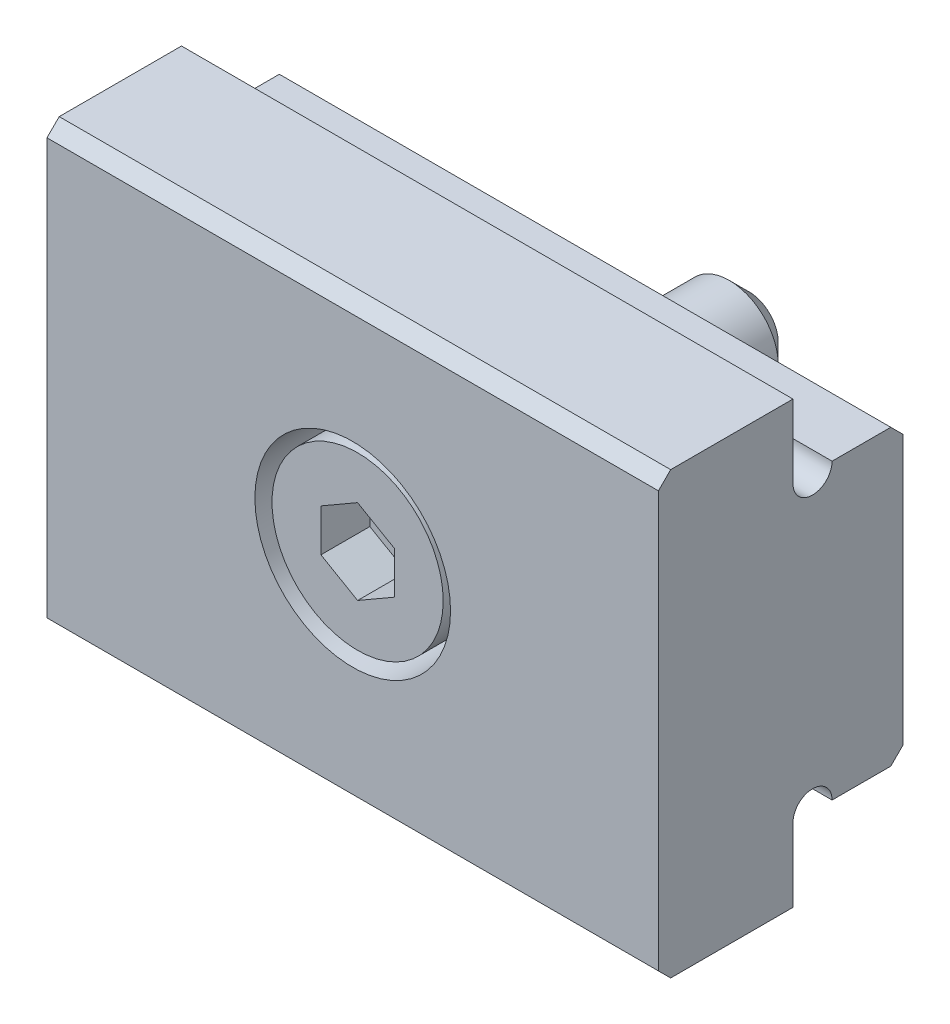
ISO-10303-21;
HEADER;
FILE_DESCRIPTION(('STEP AP214'),'2;1');
FILE_NAME('part.step','',(''),(''),'','','');
FILE_SCHEMA(('AUTOMOTIVE_DESIGN { 1 0 10303 214 1 1 1 1 }'));
ENDSEC;
DATA;
#1=APPLICATION_CONTEXT('core data for automotive mechanical design processes');
#2=APPLICATION_PROTOCOL_DEFINITION('international standard','automotive_design',2000,#1);
#3=PRODUCT_CONTEXT('',#1,'mechanical');
#4=PRODUCT('Part','Part','',(#3));
#5=PRODUCT_RELATED_PRODUCT_CATEGORY('part','',(#4));
#6=PRODUCT_DEFINITION_FORMATION('','',#4);
#7=PRODUCT_DEFINITION_CONTEXT('part definition',#1,'design');
#8=PRODUCT_DEFINITION('design','',#6,#7);
#9=PRODUCT_DEFINITION_SHAPE('','',#8);
#10=(LENGTH_UNIT() NAMED_UNIT(*) SI_UNIT(.MILLI.,.METRE.));
#11=(NAMED_UNIT(*) PLANE_ANGLE_UNIT() SI_UNIT($,.RADIAN.));
#12=(NAMED_UNIT(*) SI_UNIT($,.STERADIAN.) SOLID_ANGLE_UNIT());
#13=UNCERTAINTY_MEASURE_WITH_UNIT(LENGTH_MEASURE(1.E-05),#10,'distance_accuracy_value','');
#14=(GEOMETRIC_REPRESENTATION_CONTEXT(3) GLOBAL_UNCERTAINTY_ASSIGNED_CONTEXT((#13)) GLOBAL_UNIT_ASSIGNED_CONTEXT((#10,
#11,#12)) REPRESENTATION_CONTEXT('',''));
#15=CARTESIAN_POINT('',(0.,0.,0.));
#16=DIRECTION('',(0.,0.,1.));
#17=DIRECTION('',(1.,0.,0.));
#18=AXIS2_PLACEMENT_3D('',#15,#16,#17);
#19=CARTESIAN_POINT('',(-12.5,-6.,-0.799999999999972));
#20=DIRECTION('',(1.,0.,0.));
#21=DIRECTION('',(0.,1.,0.));
#22=AXIS2_PLACEMENT_3D('',#19,#20,#21);
#23=CYLINDRICAL_SURFACE('',#22,0.8);
#24=CARTESIAN_POINT('',(12.5,-6.,-0.799999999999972));
#25=DIRECTION('',(1.,0.,0.));
#26=DIRECTION('',(0.,-1.,0.));
#27=AXIS2_PLACEMENT_3D('',#24,#25,#26);
#28=CIRCLE('',#27,0.8);
#29=CARTESIAN_POINT('',(12.5,-6.,-1.59999999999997));
#30=VERTEX_POINT('',#29);
#31=CARTESIAN_POINT('',(12.5,-6.,0.));
#32=VERTEX_POINT('',#31);
#33=EDGE_CURVE('E86',#30,#32,#28,.T.);
#34=ORIENTED_EDGE('',*,*,#33,.T.);
#35=DIRECTION('',(1.,0.,0.));
#36=VECTOR('',#35,1.);
#37=CARTESIAN_POINT('',(-12.5,-6.,0.));
#38=LINE('',#37,#36);
#39=CARTESIAN_POINT('',(-12.5,-6.,0.));
#40=VERTEX_POINT('',#39);
#41=EDGE_CURVE('E217',#40,#32,#38,.T.);
#42=ORIENTED_EDGE('',*,*,#41,.F.);
#43=CARTESIAN_POINT('',(-12.5,-6.,-0.799999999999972));
#44=DIRECTION('',(1.,0.,0.));
#45=DIRECTION('',(0.,-1.,0.));
#46=AXIS2_PLACEMENT_3D('',#43,#44,#45);
#47=CIRCLE('',#46,0.8);
#48=CARTESIAN_POINT('',(-12.5,-6.,-1.59999999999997));
#49=VERTEX_POINT('',#48);
#50=EDGE_CURVE('E321',#49,#40,#47,.T.);
#51=ORIENTED_EDGE('',*,*,#50,.F.);
#52=DIRECTION('',(1.,0.,0.));
#53=VECTOR('',#52,1.);
#54=CARTESIAN_POINT('',(-12.5,-6.,-1.59999999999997));
#55=LINE('',#54,#53);
#56=EDGE_CURVE('E24',#49,#30,#55,.T.);
#57=ORIENTED_EDGE('',*,*,#56,.T.);
#58=EDGE_LOOP('',(#34,#42,#51,#57));
#59=FACE_BOUND('',#58,.T.);
#60=ADVANCED_FACE('F14',(#59),#23,.F.);
#61=CARTESIAN_POINT('',(-12.5,-6.,0.));
#62=DIRECTION('',(0.,0.,1.));
#63=DIRECTION('',(0.,1.,0.));
#64=AXIS2_PLACEMENT_3D('',#61,#62,#63);
#65=PLANE('',#64);
#66=DIRECTION('',(0.,-1.,0.));
#67=VECTOR('',#66,1.);
#68=CARTESIAN_POINT('',(12.5,-6.,0.));
#69=LINE('',#68,#67);
#70=CARTESIAN_POINT('',(12.5,-9.,0.));
#71=VERTEX_POINT('',#70);
#72=EDGE_CURVE('E296',#32,#71,#69,.T.);
#73=ORIENTED_EDGE('',*,*,#72,.T.);
#74=DIRECTION('',(1.,0.,0.));
#75=VECTOR('',#74,1.);
#76=CARTESIAN_POINT('',(-12.5,-9.,0.));
#77=LINE('',#76,#75);
#78=CARTESIAN_POINT('',(-12.5,-9.,0.));
#79=VERTEX_POINT('',#78);
#80=EDGE_CURVE('E214',#79,#71,#77,.T.);
#81=ORIENTED_EDGE('',*,*,#80,.F.);
#82=DIRECTION('',(0.,-1.,0.));
#83=VECTOR('',#82,1.);
#84=CARTESIAN_POINT('',(-12.5,-6.,0.));
#85=LINE('',#84,#83);
#86=EDGE_CURVE('E323',#40,#79,#85,.T.);
#87=ORIENTED_EDGE('',*,*,#86,.F.);
#88=ORIENTED_EDGE('',*,*,#41,.T.);
#89=EDGE_LOOP('',(#73,#81,#87,#88));
#90=FACE_BOUND('',#89,.T.);
#91=ADVANCED_FACE('F361',(#90),#65,.F.);
#92=CARTESIAN_POINT('',(-12.5,-9.,5.));
#93=DIRECTION('',(0.,1.,0.));
#94=DIRECTION('',(-1.,0.,0.));
#95=AXIS2_PLACEMENT_3D('',#92,#93,#94);
#96=PLANE('',#95);
#97=DIRECTION('',(0.,0.,1.));
#98=VECTOR('',#97,1.);
#99=CARTESIAN_POINT('',(12.5,-9.,5.));
#100=LINE('',#99,#98);
#101=CARTESIAN_POINT('',(12.5,-9.,5.));
#102=VERTEX_POINT('',#101);
#103=EDGE_CURVE('E298',#71,#102,#100,.T.);
#104=ORIENTED_EDGE('',*,*,#103,.T.);
#105=DIRECTION('',(1.,0.,0.));
#106=VECTOR('',#105,1.);
#107=CARTESIAN_POINT('',(-12.5,-9.,5.));
#108=LINE('',#107,#106);
#109=CARTESIAN_POINT('',(-12.5,-9.,5.));
#110=VERTEX_POINT('',#109);
#111=EDGE_CURVE('E211',#110,#102,#108,.T.);
#112=ORIENTED_EDGE('',*,*,#111,.F.);
#113=DIRECTION('',(0.,0.,1.));
#114=VECTOR('',#113,1.);
#115=CARTESIAN_POINT('',(-12.5,-9.,5.));
#116=LINE('',#115,#114);
#117=EDGE_CURVE('E325',#79,#110,#116,.T.);
#118=ORIENTED_EDGE('',*,*,#117,.F.);
#119=ORIENTED_EDGE('',*,*,#80,.T.);
#120=EDGE_LOOP('',(#104,#112,#118,#119));
#121=FACE_BOUND('',#120,.T.);
#122=ADVANCED_FACE('F366',(#121),#96,.F.);
#123=CARTESIAN_POINT('',(-12.5,-8.5,5.5));
#124=DIRECTION('',(0.,0.707106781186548,-0.707106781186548));
#125=DIRECTION('',(0.,-0.707106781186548,-0.707106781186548));
#126=AXIS2_PLACEMENT_3D('',#123,#124,#125);
#127=PLANE('',#126);
#128=DIRECTION('',(0.,0.707106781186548,0.707106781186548));
#129=VECTOR('',#128,1.);
#130=CARTESIAN_POINT('',(12.5,-8.5,5.5));
#131=LINE('',#130,#129);
#132=CARTESIAN_POINT('',(12.5,-8.5,5.5));
#133=VERTEX_POINT('',#132);
#134=EDGE_CURVE('E300',#102,#133,#131,.T.);
#135=ORIENTED_EDGE('',*,*,#134,.T.);
#136=DIRECTION('',(1.,0.,0.));
#137=VECTOR('',#136,1.);
#138=CARTESIAN_POINT('',(-12.5,-8.5,5.5));
#139=LINE('',#138,#137);
#140=CARTESIAN_POINT('',(-12.5,-8.5,5.5));
#141=VERTEX_POINT('',#140);
#142=EDGE_CURVE('E208',#141,#133,#139,.T.);
#143=ORIENTED_EDGE('',*,*,#142,.F.);
#144=DIRECTION('',(0.,0.707106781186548,0.707106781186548));
#145=VECTOR('',#144,1.);
#146=CARTESIAN_POINT('',(-12.5,-8.5,5.5));
#147=LINE('',#146,#145);
#148=EDGE_CURVE('E327',#110,#141,#147,.T.);
#149=ORIENTED_EDGE('',*,*,#148,.F.);
#150=ORIENTED_EDGE('',*,*,#111,.T.);
#151=EDGE_LOOP('',(#135,#143,#149,#150));
#152=FACE_BOUND('',#151,.T.);
#153=ADVANCED_FACE('F372',(#152),#127,.F.);
#154=CARTESIAN_POINT('',(-12.5,-8.5,5.5));
#155=DIRECTION('',(0.,0.,-1.));
#156=DIRECTION('',(0.,-1.,0.));
#157=AXIS2_PLACEMENT_3D('',#154,#155,#156);
#158=PLANE('',#157);
#159=CARTESIAN_POINT('',(0.,0.,5.5));
#160=DIRECTION('',(0.,0.,1.));
#161=DIRECTION('',(-1.,0.,0.));
#162=AXIS2_PLACEMENT_3D('',#159,#160,#161);
#163=CIRCLE('',#162,4.);
#164=CARTESIAN_POINT('',(-4.,0.,5.5));
#165=VERTEX_POINT('',#164);
#166=EDGE_CURVE('E289',#165,#165,#163,.T.);
#167=ORIENTED_EDGE('',*,*,#166,.F.);
#168=EDGE_LOOP('',(#167));
#169=FACE_BOUND('',#168,.T.);
#170=DIRECTION('',(0.,1.,0.));
#171=VECTOR('',#170,1.);
#172=CARTESIAN_POINT('',(12.5,-8.5,5.5));
#173=LINE('',#172,#171);
#174=CARTESIAN_POINT('',(12.5,8.5,5.5));
#175=VERTEX_POINT('',#174);
#176=EDGE_CURVE('E302',#133,#175,#173,.T.);
#177=ORIENTED_EDGE('',*,*,#176,.T.);
#178=DIRECTION('',(1.,0.,0.));
#179=VECTOR('',#178,1.);
#180=CARTESIAN_POINT('',(-12.5,8.5,5.5));
#181=LINE('',#180,#179);
#182=CARTESIAN_POINT('',(-12.5,8.5,5.5));
#183=VERTEX_POINT('',#182);
#184=EDGE_CURVE('E205',#183,#175,#181,.T.);
#185=ORIENTED_EDGE('',*,*,#184,.F.);
#186=DIRECTION('',(0.,1.,0.));
#187=VECTOR('',#186,1.);
#188=CARTESIAN_POINT('',(-12.5,-8.5,5.5));
#189=LINE('',#188,#187);
#190=EDGE_CURVE('E329',#141,#183,#189,.T.);
#191=ORIENTED_EDGE('',*,*,#190,.F.);
#192=ORIENTED_EDGE('',*,*,#142,.T.);
#193=EDGE_LOOP('',(#177,#185,#191,#192));
#194=FACE_BOUND('',#193,.T.);
#195=ADVANCED_FACE('F376',(#169,#194),#158,.F.);
#196=CARTESIAN_POINT('',(0.,0.,5.5));
#197=DIRECTION('',(0.,0.,1.));
#198=DIRECTION('',(-1.,0.,0.));
#199=AXIS2_PLACEMENT_3D('',#196,#197,#198);
#200=CYLINDRICAL_SURFACE('',#199,4.);
#201=CARTESIAN_POINT('',(0.,0.,1.30000000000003));
#202=DIRECTION('',(0.,0.,1.));
#203=DIRECTION('',(-1.,0.,0.));
#204=AXIS2_PLACEMENT_3D('',#201,#202,#203);
#205=CIRCLE('',#204,4.);
#206=CARTESIAN_POINT('',(-4.,0.,1.30000000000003));
#207=VERTEX_POINT('',#206);
#208=EDGE_CURVE('E284',#207,#207,#205,.T.);
#209=ORIENTED_EDGE('',*,*,#208,.F.);
#210=EDGE_LOOP('',(#209));
#211=FACE_BOUND('',#210,.T.);
#212=ORIENTED_EDGE('',*,*,#166,.T.);
#213=EDGE_LOOP('',(#212));
#214=FACE_BOUND('',#213,.T.);
#215=ADVANCED_FACE('F606',(#211,#214),#200,.F.);
#216=CARTESIAN_POINT('',(0.,-2.4,1.30000000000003));
#217=DIRECTION('',(0.,0.,-1.));
#218=DIRECTION('',(1.,0.,0.));
#219=AXIS2_PLACEMENT_3D('',#216,#217,#218);
#220=PLANE('',#219);
#221=CARTESIAN_POINT('',(0.,0.,1.30000000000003));
#222=DIRECTION('',(0.,0.,-1.));
#223=DIRECTION('',(-1.,0.,0.));
#224=AXIS2_PLACEMENT_3D('',#221,#222,#223);
#225=CIRCLE('',#224,3.5);
#226=CARTESIAN_POINT('',(-3.5,0.,1.30000000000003));
#227=VERTEX_POINT('',#226);
#228=EDGE_CURVE('E9',#227,#227,#225,.T.);
#229=ORIENTED_EDGE('',*,*,#228,.T.);
#230=EDGE_LOOP('',(#229));
#231=FACE_BOUND('',#230,.T.);
#232=ORIENTED_EDGE('',*,*,#208,.T.);
#233=EDGE_LOOP('',(#232));
#234=FACE_BOUND('',#233,.T.);
#235=ADVANCED_FACE('F597',(#231,#234),#220,.F.);
#236=CARTESIAN_POINT('',(-12.5,8.5,5.5));
#237=DIRECTION('',(0.,-0.707106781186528,-0.707106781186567));
#238=DIRECTION('',(0.,-0.707106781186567,0.707106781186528));
#239=AXIS2_PLACEMENT_3D('',#236,#237,#238);
#240=PLANE('',#239);
#241=DIRECTION('',(0.,0.707106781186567,-0.707106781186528));
#242=VECTOR('',#241,1.);
#243=CARTESIAN_POINT('',(12.5,8.5,5.5));
#244=LINE('',#243,#242);
#245=CARTESIAN_POINT('',(12.5,9.,5.));
#246=VERTEX_POINT('',#245);
#247=EDGE_CURVE('E304',#175,#246,#244,.T.);
#248=ORIENTED_EDGE('',*,*,#247,.T.);
#249=DIRECTION('',(1.,0.,0.));
#250=VECTOR('',#249,1.);
#251=CARTESIAN_POINT('',(-12.5,9.,5.));
#252=LINE('',#251,#250);
#253=CARTESIAN_POINT('',(-12.5,9.,5.));
#254=VERTEX_POINT('',#253);
#255=EDGE_CURVE('E202',#254,#246,#252,.T.);
#256=ORIENTED_EDGE('',*,*,#255,.F.);
#257=DIRECTION('',(0.,0.707106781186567,-0.707106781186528));
#258=VECTOR('',#257,1.);
#259=CARTESIAN_POINT('',(-12.5,8.5,5.5));
#260=LINE('',#259,#258);
#261=EDGE_CURVE('E331',#183,#254,#260,.T.);
#262=ORIENTED_EDGE('',*,*,#261,.F.);
#263=ORIENTED_EDGE('',*,*,#184,.T.);
#264=EDGE_LOOP('',(#248,#256,#262,#263));
#265=FACE_BOUND('',#264,.T.);
#266=ADVANCED_FACE('F381',(#265),#240,.F.);
#267=CARTESIAN_POINT('',(-12.5,9.,5.));
#268=DIRECTION('',(0.,-1.,0.));
#269=DIRECTION('',(1.,0.,0.));
#270=AXIS2_PLACEMENT_3D('',#267,#268,#269);
#271=PLANE('',#270);
#272=DIRECTION('',(0.,0.,-1.));
#273=VECTOR('',#272,1.);
#274=CARTESIAN_POINT('',(12.5,9.,5.));
#275=LINE('',#274,#273);
#276=CARTESIAN_POINT('',(12.5,9.,0.));
#277=VERTEX_POINT('',#276);
#278=EDGE_CURVE('E306',#246,#277,#275,.T.);
#279=ORIENTED_EDGE('',*,*,#278,.T.);
#280=DIRECTION('',(1.,0.,0.));
#281=VECTOR('',#280,1.);
#282=CARTESIAN_POINT('',(-12.5,9.,0.));
#283=LINE('',#282,#281);
#284=CARTESIAN_POINT('',(-12.5,9.,0.));
#285=VERTEX_POINT('',#284);
#286=EDGE_CURVE('E199',#285,#277,#283,.T.);
#287=ORIENTED_EDGE('',*,*,#286,.F.);
#288=DIRECTION('',(0.,0.,-1.));
#289=VECTOR('',#288,1.);
#290=CARTESIAN_POINT('',(-12.5,9.,5.));
#291=LINE('',#290,#289);
#292=EDGE_CURVE('E333',#254,#285,#291,.T.);
#293=ORIENTED_EDGE('',*,*,#292,.F.);
#294=ORIENTED_EDGE('',*,*,#255,.T.);
#295=EDGE_LOOP('',(#279,#287,#293,#294));
#296=FACE_BOUND('',#295,.T.);
#297=ADVANCED_FACE('F385',(#296),#271,.F.);
#298=CARTESIAN_POINT('',(-12.5,9.,0.));
#299=DIRECTION('',(0.,0.,1.));
#300=DIRECTION('',(0.,1.,0.));
#301=AXIS2_PLACEMENT_3D('',#298,#299,#300);
#302=PLANE('',#301);
#303=DIRECTION('',(0.,-1.,0.));
#304=VECTOR('',#303,1.);
#305=CARTESIAN_POINT('',(12.5,9.,0.));
#306=LINE('',#305,#304);
#307=CARTESIAN_POINT('',(12.5,6.,0.));
#308=VERTEX_POINT('',#307);
#309=EDGE_CURVE('E308',#277,#308,#306,.T.);
#310=ORIENTED_EDGE('',*,*,#309,.T.);
#311=DIRECTION('',(1.,0.,0.));
#312=VECTOR('',#311,1.);
#313=CARTESIAN_POINT('',(-12.5,6.,0.));
#314=LINE('',#313,#312);
#315=CARTESIAN_POINT('',(-12.5,6.,0.));
#316=VERTEX_POINT('',#315);
#317=EDGE_CURVE('E196',#316,#308,#314,.T.);
#318=ORIENTED_EDGE('',*,*,#317,.F.);
#319=DIRECTION('',(0.,-1.,0.));
#320=VECTOR('',#319,1.);
#321=CARTESIAN_POINT('',(-12.5,9.,0.));
#322=LINE('',#321,#320);
#323=EDGE_CURVE('E335',#285,#316,#322,.T.);
#324=ORIENTED_EDGE('',*,*,#323,.F.);
#325=ORIENTED_EDGE('',*,*,#286,.T.);
#326=EDGE_LOOP('',(#310,#318,#324,#325));
#327=FACE_BOUND('',#326,.T.);
#328=ADVANCED_FACE('F389',(#327),#302,.F.);
#329=CARTESIAN_POINT('',(-12.5,6.,-0.799999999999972));
#330=DIRECTION('',(1.,0.,0.));
#331=DIRECTION('',(0.,1.,0.));
#332=AXIS2_PLACEMENT_3D('',#329,#330,#331);
#333=CYLINDRICAL_SURFACE('',#332,0.8);
#334=CARTESIAN_POINT('',(12.5,6.,-0.799999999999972));
#335=DIRECTION('',(1.,0.,0.));
#336=DIRECTION('',(0.,-1.,0.));
#337=AXIS2_PLACEMENT_3D('',#334,#335,#336);
#338=CIRCLE('',#337,0.8);
#339=CARTESIAN_POINT('',(12.5,6.,-1.59999999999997));
#340=VERTEX_POINT('',#339);
#341=EDGE_CURVE('E310',#308,#340,#338,.T.);
#342=ORIENTED_EDGE('',*,*,#341,.T.);
#343=DIRECTION('',(1.,0.,0.));
#344=VECTOR('',#343,1.);
#345=CARTESIAN_POINT('',(-12.5,6.,-1.59999999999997));
#346=LINE('',#345,#344);
#347=CARTESIAN_POINT('',(-12.5,6.,-1.59999999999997));
#348=VERTEX_POINT('',#347);
#349=EDGE_CURVE('E193',#348,#340,#346,.T.);
#350=ORIENTED_EDGE('',*,*,#349,.F.);
#351=CARTESIAN_POINT('',(-12.5,6.,-0.799999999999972));
#352=DIRECTION('',(1.,0.,0.));
#353=DIRECTION('',(0.,-1.,0.));
#354=AXIS2_PLACEMENT_3D('',#351,#352,#353);
#355=CIRCLE('',#354,0.8);
#356=EDGE_CURVE('E337',#316,#348,#355,.T.);
#357=ORIENTED_EDGE('',*,*,#356,.F.);
#358=ORIENTED_EDGE('',*,*,#317,.T.);
#359=EDGE_LOOP('',(#342,#350,#357,#358));
#360=FACE_BOUND('',#359,.T.);
#361=ADVANCED_FACE('F343',(#360),#333,.F.);
#362=CARTESIAN_POINT('',(-12.5,6.,-1.59999999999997));
#363=DIRECTION('',(0.,-1.,0.));
#364=DIRECTION('',(0.,0.,1.));
#365=AXIS2_PLACEMENT_3D('',#362,#363,#364);
#366=PLANE('',#365);
#367=DIRECTION('',(0.,0.,-1.));
#368=VECTOR('',#367,1.);
#369=CARTESIAN_POINT('',(12.5,6.,-1.59999999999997));
#370=LINE('',#369,#368);
#371=CARTESIAN_POINT('',(12.5,6.,-4.));
#372=VERTEX_POINT('',#371);
#373=EDGE_CURVE('E312',#340,#372,#370,.T.);
#374=ORIENTED_EDGE('',*,*,#373,.T.);
#375=DIRECTION('',(1.,0.,0.));
#376=VECTOR('',#375,1.);
#377=CARTESIAN_POINT('',(-12.5,6.,-4.));
#378=LINE('',#377,#376);
#379=CARTESIAN_POINT('',(-12.5,6.,-4.));
#380=VERTEX_POINT('',#379);
#381=EDGE_CURVE('E179',#380,#372,#378,.T.);
#382=ORIENTED_EDGE('',*,*,#381,.F.);
#383=DIRECTION('',(0.,0.,-1.));
#384=VECTOR('',#383,1.);
#385=CARTESIAN_POINT('',(-12.5,6.,-1.59999999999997));
#386=LINE('',#385,#384);
#387=EDGE_CURVE('E167',#348,#380,#386,.T.);
#388=ORIENTED_EDGE('',*,*,#387,.F.);
#389=ORIENTED_EDGE('',*,*,#349,.T.);
#390=EDGE_LOOP('',(#374,#382,#388,#389));
#391=FACE_BOUND('',#390,.T.);
#392=ADVANCED_FACE('F347',(#391),#366,.F.);
#393=CARTESIAN_POINT('',(-12.5,-6.,-1.59999999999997));
#394=DIRECTION('',(0.,1.,0.));
#395=DIRECTION('',(-1.,0.,0.));
#396=AXIS2_PLACEMENT_3D('',#393,#394,#395);
#397=PLANE('',#396);
#398=DIRECTION('',(0.,0.,1.));
#399=VECTOR('',#398,1.);
#400=CARTESIAN_POINT('',(12.5,-6.,-1.59999999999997));
#401=LINE('',#400,#399);
#402=CARTESIAN_POINT('',(12.5,-6.,-4.));
#403=VERTEX_POINT('',#402);
#404=EDGE_CURVE('E292',#403,#30,#401,.T.);
#405=ORIENTED_EDGE('',*,*,#404,.T.);
#406=ORIENTED_EDGE('',*,*,#56,.F.);
#407=DIRECTION('',(0.,0.,1.));
#408=VECTOR('',#407,1.);
#409=CARTESIAN_POINT('',(-12.5,-6.,-1.59999999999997));
#410=LINE('',#409,#408);
#411=CARTESIAN_POINT('',(-12.5,-6.,-4.));
#412=VERTEX_POINT('',#411);
#413=EDGE_CURVE('E319',#412,#49,#410,.T.);
#414=ORIENTED_EDGE('',*,*,#413,.F.);
#415=DIRECTION('',(1.,0.,0.));
#416=VECTOR('',#415,1.);
#417=CARTESIAN_POINT('',(-12.5,-6.,-4.));
#418=LINE('',#417,#416);
#419=EDGE_CURVE('E185',#412,#403,#418,.T.);
#420=ORIENTED_EDGE('',*,*,#419,.T.);
#421=EDGE_LOOP('',(#405,#406,#414,#420));
#422=FACE_BOUND('',#421,.T.);
#423=ADVANCED_FACE('F355',(#422),#397,.F.);
#424=CARTESIAN_POINT('',(-12.5,6.,-4.));
#425=DIRECTION('',(0.,-0.707106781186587,0.707106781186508));
#426=DIRECTION('',(0.,0.707106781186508,0.707106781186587));
#427=AXIS2_PLACEMENT_3D('',#424,#425,#426);
#428=PLANE('',#427);
#429=DIRECTION('',(0.,-0.707106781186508,-0.707106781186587));
#430=VECTOR('',#429,1.);
#431=CARTESIAN_POINT('',(12.5,6.,-4.));
#432=LINE('',#431,#430);
#433=CARTESIAN_POINT('',(12.5,5.5,-4.5));
#434=VERTEX_POINT('',#433);
#435=EDGE_CURVE('E176',#372,#434,#432,.T.);
#436=ORIENTED_EDGE('',*,*,#435,.T.);
#437=DIRECTION('',(1.,0.,0.));
#438=VECTOR('',#437,1.);
#439=CARTESIAN_POINT('',(-12.5,5.5,-4.5));
#440=LINE('',#439,#438);
#441=CARTESIAN_POINT('',(-12.5,5.5,-4.5));
#442=VERTEX_POINT('',#441);
#443=EDGE_CURVE('E173',#442,#434,#440,.T.);
#444=ORIENTED_EDGE('',*,*,#443,.F.);
#445=DIRECTION('',(0.,-0.707106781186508,-0.707106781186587));
#446=VECTOR('',#445,1.);
#447=CARTESIAN_POINT('',(-12.5,6.,-4.));
#448=LINE('',#447,#446);
#449=EDGE_CURVE('E160',#380,#442,#448,.T.);
#450=ORIENTED_EDGE('',*,*,#449,.F.);
#451=ORIENTED_EDGE('',*,*,#381,.T.);
#452=EDGE_LOOP('',(#436,#444,#450,#451));
#453=FACE_BOUND('',#452,.T.);
#454=ADVANCED_FACE('F174',(#453),#428,.F.);
#455=CARTESIAN_POINT('',(-12.5,6.,-0.799999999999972));
#456=DIRECTION('',(-1.,0.,0.));
#457=DIRECTION('',(0.,-1.,0.));
#458=AXIS2_PLACEMENT_3D('',#455,#456,#457);
#459=PLANE('',#458);
#460=ORIENTED_EDGE('',*,*,#413,.T.);
#461=ORIENTED_EDGE('',*,*,#50,.T.);
#462=ORIENTED_EDGE('',*,*,#86,.T.);
#463=ORIENTED_EDGE('',*,*,#117,.T.);
#464=ORIENTED_EDGE('',*,*,#148,.T.);
#465=ORIENTED_EDGE('',*,*,#190,.T.);
#466=ORIENTED_EDGE('',*,*,#261,.T.);
#467=ORIENTED_EDGE('',*,*,#292,.T.);
#468=ORIENTED_EDGE('',*,*,#323,.T.);
#469=ORIENTED_EDGE('',*,*,#356,.T.);
#470=ORIENTED_EDGE('',*,*,#387,.T.);
#471=ORIENTED_EDGE('',*,*,#449,.T.);
#472=DIRECTION('',(0.,-1.,0.));
#473=VECTOR('',#472,1.);
#474=CARTESIAN_POINT('',(-12.5,5.5,-4.5));
#475=LINE('',#474,#473);
#476=CARTESIAN_POINT('',(-12.5,-5.5,-4.5));
#477=VERTEX_POINT('',#476);
#478=EDGE_CURVE('E164',#442,#477,#475,.T.);
#479=ORIENTED_EDGE('',*,*,#478,.T.);
#480=DIRECTION('',(0.,-0.707106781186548,0.707106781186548));
#481=VECTOR('',#480,1.);
#482=CARTESIAN_POINT('',(-12.5,-6.,-4.));
#483=LINE('',#482,#481);
#484=EDGE_CURVE('E33',#477,#412,#483,.T.);
#485=ORIENTED_EDGE('',*,*,#484,.T.);
#486=EDGE_LOOP('',(#460,#461,#462,#463,#464,#465,#466,#467,#468,#469,#470,#471,#479,#485));
#487=FACE_BOUND('',#486,.T.);
#488=ADVANCED_FACE('F162',(#487),#459,.T.);
#489=CARTESIAN_POINT('',(-12.5,-6.,-4.));
#490=DIRECTION('',(0.,0.707106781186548,0.707106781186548));
#491=DIRECTION('',(0.,0.707106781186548,-0.707106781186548));
#492=AXIS2_PLACEMENT_3D('',#489,#490,#491);
#493=PLANE('',#492);
#494=DIRECTION('',(0.,-0.707106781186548,0.707106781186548));
#495=VECTOR('',#494,1.);
#496=CARTESIAN_POINT('',(12.5,-6.,-4.));
#497=LINE('',#496,#495);
#498=CARTESIAN_POINT('',(12.5,-5.5,-4.5));
#499=VERTEX_POINT('',#498);
#500=EDGE_CURVE('E317',#499,#403,#497,.T.);
#501=ORIENTED_EDGE('',*,*,#500,.T.);
#502=ORIENTED_EDGE('',*,*,#419,.F.);
#503=ORIENTED_EDGE('',*,*,#484,.F.);
#504=DIRECTION('',(1.,0.,0.));
#505=VECTOR('',#504,1.);
#506=CARTESIAN_POINT('',(-12.5,-5.5,-4.5));
#507=LINE('',#506,#505);
#508=EDGE_CURVE('E180',#477,#499,#507,.T.);
#509=ORIENTED_EDGE('',*,*,#508,.T.);
#510=EDGE_LOOP('',(#501,#502,#503,#509));
#511=FACE_BOUND('',#510,.T.);
#512=ADVANCED_FACE('F351',(#511),#493,.F.);
#513=CARTESIAN_POINT('',(12.5,6.,-0.799999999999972));
#514=DIRECTION('',(-1.,0.,0.));
#515=DIRECTION('',(0.,-1.,0.));
#516=AXIS2_PLACEMENT_3D('',#513,#514,#515);
#517=PLANE('',#516);
#518=ORIENTED_EDGE('',*,*,#404,.F.);
#519=ORIENTED_EDGE('',*,*,#500,.F.);
#520=DIRECTION('',(0.,-1.,0.));
#521=VECTOR('',#520,1.);
#522=CARTESIAN_POINT('',(12.5,5.5,-4.5));
#523=LINE('',#522,#521);
#524=EDGE_CURVE('E315',#434,#499,#523,.T.);
#525=ORIENTED_EDGE('',*,*,#524,.F.);
#526=ORIENTED_EDGE('',*,*,#435,.F.);
#527=ORIENTED_EDGE('',*,*,#373,.F.);
#528=ORIENTED_EDGE('',*,*,#341,.F.);
#529=ORIENTED_EDGE('',*,*,#309,.F.);
#530=ORIENTED_EDGE('',*,*,#278,.F.);
#531=ORIENTED_EDGE('',*,*,#247,.F.);
#532=ORIENTED_EDGE('',*,*,#176,.F.);
#533=ORIENTED_EDGE('',*,*,#134,.F.);
#534=ORIENTED_EDGE('',*,*,#103,.F.);
#535=ORIENTED_EDGE('',*,*,#72,.F.);
#536=ORIENTED_EDGE('',*,*,#33,.F.);
#537=EDGE_LOOP('',(#518,#519,#525,#526,#527,#528,#529,#530,#531,#532,#533,#534,#535,#536));
#538=FACE_BOUND('',#537,.T.);
#539=ADVANCED_FACE('F348',(#538),#517,.F.);
#540=CARTESIAN_POINT('',(-12.5,5.5,-4.5));
#541=DIRECTION('',(0.,0.,1.));
#542=DIRECTION('',(-1.,0.,0.));
#543=AXIS2_PLACEMENT_3D('',#540,#541,#542);
#544=PLANE('',#543);
#545=CARTESIAN_POINT('',(0.,0.,-4.5));
#546=DIRECTION('',(0.,0.,1.));
#547=DIRECTION('',(-1.,0.,0.));
#548=AXIS2_PLACEMENT_3D('',#545,#546,#547);
#549=CIRCLE('',#548,2.4);
#550=CARTESIAN_POINT('',(-2.4,0.,-4.5));
#551=VERTEX_POINT('',#550);
#552=EDGE_CURVE('E275',#551,#551,#549,.T.);
#553=ORIENTED_EDGE('',*,*,#552,.T.);
#554=EDGE_LOOP('',(#553));
#555=FACE_BOUND('',#554,.T.);
#556=ORIENTED_EDGE('',*,*,#524,.T.);
#557=ORIENTED_EDGE('',*,*,#508,.F.);
#558=ORIENTED_EDGE('',*,*,#478,.F.);
#559=ORIENTED_EDGE('',*,*,#443,.T.);
#560=EDGE_LOOP('',(#556,#557,#558,#559));
#561=FACE_BOUND('',#560,.T.);
#562=ADVANCED_FACE('F182',(#555,#561),#544,.F.);
#563=CARTESIAN_POINT('',(0.,0.,5.5));
#564=DIRECTION('',(0.,0.,1.));
#565=DIRECTION('',(-1.,0.,0.));
#566=AXIS2_PLACEMENT_3D('',#563,#564,#565);
#567=CYLINDRICAL_SURFACE('',#566,2.4);
#568=ORIENTED_EDGE('',*,*,#552,.F.);
#569=EDGE_LOOP('',(#568));
#570=FACE_BOUND('',#569,.T.);
#571=CARTESIAN_POINT('',(0.,0.,1.30000000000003));
#572=DIRECTION('',(0.,0.,1.));
#573=DIRECTION('',(-1.,0.,0.));
#574=AXIS2_PLACEMENT_3D('',#571,#572,#573);
#575=CIRCLE('',#574,2.4);
#576=CARTESIAN_POINT('',(-2.4,0.,1.30000000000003));
#577=VERTEX_POINT('',#576);
#578=EDGE_CURVE('E279',#577,#577,#575,.T.);
#579=ORIENTED_EDGE('',*,*,#578,.T.);
#580=EDGE_LOOP('',(#579));
#581=FACE_BOUND('',#580,.T.);
#582=ADVANCED_FACE('F443',(#570,#581),#567,.F.);
#583=CARTESIAN_POINT('',(2.,0.,-10.7));
#584=DIRECTION('',(0.,0.,-1.));
#585=DIRECTION('',(-1.,0.,0.));
#586=AXIS2_PLACEMENT_3D('',#583,#584,#585);
#587=PLANE('',#586);
#588=CARTESIAN_POINT('',(0.,0.,-10.7));
#589=DIRECTION('',(0.,0.,-1.));
#590=DIRECTION('',(-1.,0.,0.));
#591=AXIS2_PLACEMENT_3D('',#588,#589,#590);
#592=CIRCLE('',#591,1.2);
#593=CARTESIAN_POINT('',(-1.2,0.,-10.7));
#594=VERTEX_POINT('',#593);
#595=EDGE_CURVE('E18',#594,#594,#592,.T.);
#596=ORIENTED_EDGE('',*,*,#595,.T.);
#597=EDGE_LOOP('',(#596));
#598=FACE_BOUND('',#597,.T.);
#599=ADVANCED_FACE('F440',(#598),#587,.T.);
#600=CARTESIAN_POINT('',(0.,0.,-9.9));
#601=DIRECTION('',(0.,0.,1.));
#602=DIRECTION('',(1.,0.,0.));
#603=AXIS2_PLACEMENT_3D('',#600,#601,#602);
#604=CONICAL_SURFACE('',#603,2.,0.785398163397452);
#605=ORIENTED_EDGE('',*,*,#595,.F.);
#606=EDGE_LOOP('',(#605));
#607=FACE_BOUND('',#606,.T.);
#608=CARTESIAN_POINT('',(0.,0.,-9.9));
#609=DIRECTION('',(0.,0.,-1.));
#610=DIRECTION('',(-1.,0.,0.));
#611=AXIS2_PLACEMENT_3D('',#608,#609,#610);
#612=CIRCLE('',#611,2.);
#613=CARTESIAN_POINT('',(-2.,0.,-9.9));
#614=VERTEX_POINT('',#613);
#615=EDGE_CURVE('E270',#614,#614,#612,.F.);
#616=ORIENTED_EDGE('',*,*,#615,.F.);
#617=EDGE_LOOP('',(#616));
#618=FACE_BOUND('',#617,.T.);
#619=ADVANCED_FACE('F16',(#607,#618),#604,.T.);
#620=CARTESIAN_POINT('',(0.,0.,9.3));
#621=DIRECTION('',(0.,0.,1.));
#622=DIRECTION('',(1.,0.,0.));
#623=AXIS2_PLACEMENT_3D('',#620,#621,#622);
#624=CYLINDRICAL_SURFACE('',#623,2.);
#625=ORIENTED_EDGE('',*,*,#615,.T.);
#626=EDGE_LOOP('',(#625));
#627=FACE_BOUND('',#626,.T.);
#628=CARTESIAN_POINT('',(0.,0.,1.30000000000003));
#629=DIRECTION('',(0.,0.,1.));
#630=DIRECTION('',(1.,0.,0.));
#631=AXIS2_PLACEMENT_3D('',#628,#629,#630);
#632=CIRCLE('',#631,2.);
#633=CARTESIAN_POINT('',(2.,0.,1.30000000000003));
#634=VERTEX_POINT('',#633);
#635=EDGE_CURVE('E265',#634,#634,#632,.T.);
#636=ORIENTED_EDGE('',*,*,#635,.F.);
#637=EDGE_LOOP('',(#636));
#638=FACE_BOUND('',#637,.T.);
#639=ADVANCED_FACE('F444',(#627,#638),#624,.T.);
#640=CARTESIAN_POINT('',(3.5,0.,1.30000000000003));
#641=DIRECTION('',(0.,0.,-1.));
#642=DIRECTION('',(-1.,0.,0.));
#643=AXIS2_PLACEMENT_3D('',#640,#641,#642);
#644=PLANE('',#643);
#645=ORIENTED_EDGE('',*,*,#635,.T.);
#646=EDGE_LOOP('',(#645));
#647=FACE_BOUND('',#646,.T.);
#648=ORIENTED_EDGE('',*,*,#578,.F.);
#649=EDGE_LOOP('',(#648));
#650=FACE_BOUND('',#649,.T.);
#651=ADVANCED_FACE('F415',(#647,#650),#644,.T.);
#652=CARTESIAN_POINT('',(1.5,0.866025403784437,3.3));
#653=DIRECTION('',(0.,0.,1.));
#654=DIRECTION('',(1.,0.,0.));
#655=AXIS2_PLACEMENT_3D('',#652,#653,#654);
#656=PLANE('',#655);
#657=DIRECTION('',(0.86602540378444,-0.5,0.));
#658=VECTOR('',#657,1.);
#659=CARTESIAN_POINT('',(0.,1.73205080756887,3.3));
#660=LINE('',#659,#658);
#661=CARTESIAN_POINT('',(0.,1.73205080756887,3.3));
#662=VERTEX_POINT('',#661);
#663=CARTESIAN_POINT('',(1.5,0.866025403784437,3.3));
#664=VERTEX_POINT('',#663);
#665=EDGE_CURVE('E224',#662,#664,#660,.T.);
#666=ORIENTED_EDGE('',*,*,#665,.F.);
#667=DIRECTION('',(-0.86602540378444,-0.5,0.));
#668=VECTOR('',#667,1.);
#669=CARTESIAN_POINT('',(0.,1.73205080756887,3.3));
#670=LINE('',#669,#668);
#671=CARTESIAN_POINT('',(-1.5,0.866025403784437,3.3));
#672=VERTEX_POINT('',#671);
#673=EDGE_CURVE('E238',#662,#672,#670,.T.);
#674=ORIENTED_EDGE('',*,*,#673,.T.);
#675=DIRECTION('',(0.,-1.,0.));
#676=VECTOR('',#675,1.);
#677=CARTESIAN_POINT('',(-1.5,0.866025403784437,3.3));
#678=LINE('',#677,#676);
#679=CARTESIAN_POINT('',(-1.5,-0.866025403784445,3.3));
#680=VERTEX_POINT('',#679);
#681=EDGE_CURVE('E241',#672,#680,#678,.T.);
#682=ORIENTED_EDGE('',*,*,#681,.T.);
#683=DIRECTION('',(-0.86602540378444,0.5,0.));
#684=VECTOR('',#683,1.);
#685=CARTESIAN_POINT('',(0.,-1.73205080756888,3.3));
#686=LINE('',#685,#684);
#687=CARTESIAN_POINT('',(0.,-1.73205080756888,3.3));
#688=VERTEX_POINT('',#687);
#689=EDGE_CURVE('E244',#688,#680,#686,.T.);
#690=ORIENTED_EDGE('',*,*,#689,.F.);
#691=DIRECTION('',(0.86602540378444,0.5,0.));
#692=VECTOR('',#691,1.);
#693=CARTESIAN_POINT('',(0.,-1.73205080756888,3.3));
#694=LINE('',#693,#692);
#695=CARTESIAN_POINT('',(1.5,-0.866025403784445,3.3));
#696=VERTEX_POINT('',#695);
#697=EDGE_CURVE('E247',#688,#696,#694,.T.);
#698=ORIENTED_EDGE('',*,*,#697,.T.);
#699=DIRECTION('',(0.,1.,0.));
#700=VECTOR('',#699,1.);
#701=CARTESIAN_POINT('',(1.5,-0.866025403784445,3.3));
#702=LINE('',#701,#700);
#703=EDGE_CURVE('E250',#696,#664,#702,.T.);
#704=ORIENTED_EDGE('',*,*,#703,.T.);
#705=EDGE_LOOP('',(#666,#674,#682,#690,#698,#704));
#706=FACE_BOUND('',#705,.T.);
#707=ADVANCED_FACE('F411',(#706),#656,.T.);
#708=CARTESIAN_POINT('',(-1.5,0.866025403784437,3.3));
#709=DIRECTION('',(-1.,0.,0.));
#710=DIRECTION('',(0.,-1.,0.));
#711=AXIS2_PLACEMENT_3D('',#708,#709,#710);
#712=PLANE('',#711);
#713=DIRECTION('',(0.,0.,1.));
#714=VECTOR('',#713,1.);
#715=CARTESIAN_POINT('',(-1.5,0.866025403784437,3.3));
#716=LINE('',#715,#714);
#717=CARTESIAN_POINT('',(-1.5,0.866025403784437,5.3));
#718=VERTEX_POINT('',#717);
#719=EDGE_CURVE('E255',#672,#718,#716,.T.);
#720=ORIENTED_EDGE('',*,*,#719,.T.);
#721=DIRECTION('',(0.,-1.,0.));
#722=VECTOR('',#721,1.);
#723=CARTESIAN_POINT('',(-1.5,0.866025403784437,5.3));
#724=LINE('',#723,#722);
#725=CARTESIAN_POINT('',(-1.5,-0.866025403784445,5.3));
#726=VERTEX_POINT('',#725);
#727=EDGE_CURVE('E225',#718,#726,#724,.T.);
#728=ORIENTED_EDGE('',*,*,#727,.T.);
#729=DIRECTION('',(0.,0.,1.));
#730=VECTOR('',#729,1.);
#731=CARTESIAN_POINT('',(-1.5,-0.866025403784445,3.3));
#732=LINE('',#731,#730);
#733=EDGE_CURVE('E257',#680,#726,#732,.T.);
#734=ORIENTED_EDGE('',*,*,#733,.F.);
#735=ORIENTED_EDGE('',*,*,#681,.F.);
#736=EDGE_LOOP('',(#720,#728,#734,#735));
#737=FACE_BOUND('',#736,.T.);
#738=ADVANCED_FACE('F414',(#737),#712,.F.);
#739=CARTESIAN_POINT('',(0.,-1.73205080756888,3.3));
#740=DIRECTION('',(0.5,0.86602540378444,0.));
#741=DIRECTION('',(-0.86602540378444,0.5,0.));
#742=AXIS2_PLACEMENT_3D('',#739,#740,#741);
#743=PLANE('',#742);
#744=ORIENTED_EDGE('',*,*,#733,.T.);
#745=DIRECTION('',(-0.86602540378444,0.5,0.));
#746=VECTOR('',#745,1.);
#747=CARTESIAN_POINT('',(0.,-1.73205080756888,5.3));
#748=LINE('',#747,#746);
#749=CARTESIAN_POINT('',(0.,-1.73205080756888,5.3));
#750=VERTEX_POINT('',#749);
#751=EDGE_CURVE('E228',#750,#726,#748,.T.);
#752=ORIENTED_EDGE('',*,*,#751,.F.);
#753=DIRECTION('',(0.,0.,1.));
#754=VECTOR('',#753,1.);
#755=CARTESIAN_POINT('',(0.,-1.73205080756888,3.3));
#756=LINE('',#755,#754);
#757=EDGE_CURVE('E259',#688,#750,#756,.T.);
#758=ORIENTED_EDGE('',*,*,#757,.F.);
#759=ORIENTED_EDGE('',*,*,#689,.T.);
#760=EDGE_LOOP('',(#744,#752,#758,#759));
#761=FACE_BOUND('',#760,.T.);
#762=ADVANCED_FACE('F428',(#761),#743,.T.);
#763=CARTESIAN_POINT('',(0.,-1.73205080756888,3.3));
#764=DIRECTION('',(0.5,-0.86602540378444,0.));
#765=DIRECTION('',(0.86602540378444,0.5,0.));
#766=AXIS2_PLACEMENT_3D('',#763,#764,#765);
#767=PLANE('',#766);
#768=ORIENTED_EDGE('',*,*,#757,.T.);
#769=DIRECTION('',(0.86602540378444,0.5,0.));
#770=VECTOR('',#769,1.);
#771=CARTESIAN_POINT('',(0.,-1.73205080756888,5.3));
#772=LINE('',#771,#770);
#773=CARTESIAN_POINT('',(1.5,-0.866025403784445,5.3));
#774=VERTEX_POINT('',#773);
#775=EDGE_CURVE('E231',#750,#774,#772,.T.);
#776=ORIENTED_EDGE('',*,*,#775,.T.);
#777=DIRECTION('',(0.,0.,1.));
#778=VECTOR('',#777,1.);
#779=CARTESIAN_POINT('',(1.5,-0.866025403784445,3.3));
#780=LINE('',#779,#778);
#781=EDGE_CURVE('E261',#696,#774,#780,.T.);
#782=ORIENTED_EDGE('',*,*,#781,.F.);
#783=ORIENTED_EDGE('',*,*,#697,.F.);
#784=EDGE_LOOP('',(#768,#776,#782,#783));
#785=FACE_BOUND('',#784,.T.);
#786=ADVANCED_FACE('F432',(#785),#767,.F.);
#787=CARTESIAN_POINT('',(1.5,-0.866025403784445,3.3));
#788=DIRECTION('',(1.,0.,0.));
#789=DIRECTION('',(0.,1.,0.));
#790=AXIS2_PLACEMENT_3D('',#787,#788,#789);
#791=PLANE('',#790);
#792=ORIENTED_EDGE('',*,*,#781,.T.);
#793=DIRECTION('',(0.,1.,0.));
#794=VECTOR('',#793,1.);
#795=CARTESIAN_POINT('',(1.5,-0.866025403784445,5.3));
#796=LINE('',#795,#794);
#797=CARTESIAN_POINT('',(1.5,0.866025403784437,5.3));
#798=VERTEX_POINT('',#797);
#799=EDGE_CURVE('E234',#774,#798,#796,.T.);
#800=ORIENTED_EDGE('',*,*,#799,.T.);
#801=DIRECTION('',(0.,0.,1.));
#802=VECTOR('',#801,1.);
#803=CARTESIAN_POINT('',(1.5,0.866025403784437,3.3));
#804=LINE('',#803,#802);
#805=EDGE_CURVE('E263',#664,#798,#804,.T.);
#806=ORIENTED_EDGE('',*,*,#805,.F.);
#807=ORIENTED_EDGE('',*,*,#703,.F.);
#808=EDGE_LOOP('',(#792,#800,#806,#807));
#809=FACE_BOUND('',#808,.T.);
#810=ADVANCED_FACE('F421',(#809),#791,.F.);
#811=CARTESIAN_POINT('',(0.,1.73205080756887,3.3));
#812=DIRECTION('',(-0.5,-0.86602540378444,0.));
#813=DIRECTION('',(0.86602540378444,-0.5,0.));
#814=AXIS2_PLACEMENT_3D('',#811,#812,#813);
#815=PLANE('',#814);
#816=ORIENTED_EDGE('',*,*,#805,.T.);
#817=DIRECTION('',(0.86602540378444,-0.5,0.));
#818=VECTOR('',#817,1.);
#819=CARTESIAN_POINT('',(0.,1.73205080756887,5.3));
#820=LINE('',#819,#818);
#821=CARTESIAN_POINT('',(0.,1.73205080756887,5.3));
#822=VERTEX_POINT('',#821);
#823=EDGE_CURVE('E78',#822,#798,#820,.T.);
#824=ORIENTED_EDGE('',*,*,#823,.F.);
#825=DIRECTION('',(0.,0.,1.));
#826=VECTOR('',#825,1.);
#827=CARTESIAN_POINT('',(0.,1.73205080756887,3.3));
#828=LINE('',#827,#826);
#829=EDGE_CURVE('E74',#662,#822,#828,.T.);
#830=ORIENTED_EDGE('',*,*,#829,.F.);
#831=ORIENTED_EDGE('',*,*,#665,.T.);
#832=EDGE_LOOP('',(#816,#824,#830,#831));
#833=FACE_BOUND('',#832,.T.);
#834=ADVANCED_FACE('F418',(#833),#815,.T.);
#835=CARTESIAN_POINT('',(0.,1.73205080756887,3.3));
#836=DIRECTION('',(-0.5,0.86602540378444,0.));
#837=DIRECTION('',(-0.86602540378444,-0.5,0.));
#838=AXIS2_PLACEMENT_3D('',#835,#836,#837);
#839=PLANE('',#838);
#840=ORIENTED_EDGE('',*,*,#673,.F.);
#841=ORIENTED_EDGE('',*,*,#829,.T.);
#842=DIRECTION('',(-0.86602540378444,-0.5,0.));
#843=VECTOR('',#842,1.);
#844=CARTESIAN_POINT('',(0.,1.73205080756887,5.3));
#845=LINE('',#844,#843);
#846=EDGE_CURVE('E221',#822,#718,#845,.T.);
#847=ORIENTED_EDGE('',*,*,#846,.T.);
#848=ORIENTED_EDGE('',*,*,#719,.F.);
#849=EDGE_LOOP('',(#840,#841,#847,#848));
#850=FACE_BOUND('',#849,.T.);
#851=ADVANCED_FACE('F417',(#850),#839,.F.);
#852=CARTESIAN_POINT('',(0.,0.,5.3));
#853=DIRECTION('',(0.,0.,1.));
#854=DIRECTION('',(1.,0.,0.));
#855=AXIS2_PLACEMENT_3D('',#852,#853,#854);
#856=PLANE('',#855);
#857=CARTESIAN_POINT('',(0.,0.,5.3));
#858=DIRECTION('',(0.,0.,1.));
#859=DIRECTION('',(1.,0.,0.));
#860=AXIS2_PLACEMENT_3D('',#857,#858,#859);
#861=CIRCLE('',#860,3.5);
#862=CARTESIAN_POINT('',(3.5,0.,5.3));
#863=VERTEX_POINT('',#862);
#864=EDGE_CURVE('E268',#863,#863,#861,.T.);
#865=ORIENTED_EDGE('',*,*,#864,.T.);
#866=EDGE_LOOP('',(#865));
#867=FACE_BOUND('',#866,.T.);
#868=ORIENTED_EDGE('',*,*,#846,.F.);
#869=ORIENTED_EDGE('',*,*,#823,.T.);
#870=ORIENTED_EDGE('',*,*,#799,.F.);
#871=ORIENTED_EDGE('',*,*,#775,.F.);
#872=ORIENTED_EDGE('',*,*,#751,.T.);
#873=ORIENTED_EDGE('',*,*,#727,.F.);
#874=EDGE_LOOP('',(#868,#869,#870,#871,#872,#873));
#875=FACE_BOUND('',#874,.T.);
#876=ADVANCED_FACE('F424',(#867,#875),#856,.T.);
#877=CARTESIAN_POINT('',(0.,0.,9.3));
#878=DIRECTION('',(0.,0.,1.));
#879=DIRECTION('',(1.,0.,0.));
#880=AXIS2_PLACEMENT_3D('',#877,#878,#879);
#881=CYLINDRICAL_SURFACE('',#880,3.5);
#882=ORIENTED_EDGE('',*,*,#228,.F.);
#883=EDGE_LOOP('',(#882));
#884=FACE_BOUND('',#883,.T.);
#885=ORIENTED_EDGE('',*,*,#864,.F.);
#886=EDGE_LOOP('',(#885));
#887=FACE_BOUND('',#886,.T.);
#888=ADVANCED_FACE('F450',(#884,#887),#881,.T.);
#889=CLOSED_SHELL('',(#60,#91,#122,#153,#195,#215,#235,#266,#297,#328,#361,#392,#423,#454,#488,
#512,#539,#562,#582,#599,#619,#639,#651,#707,#738,#762,#786,#810,#834,#851,#876,#888));
#890=MANIFOLD_SOLID_BREP('B1',#889);
#891=ADVANCED_BREP_SHAPE_REPRESENTATION('',(#18,#890),#14);
#892=SHAPE_DEFINITION_REPRESENTATION(#9,#891);
ENDSEC;
END-ISO-10303-21;
